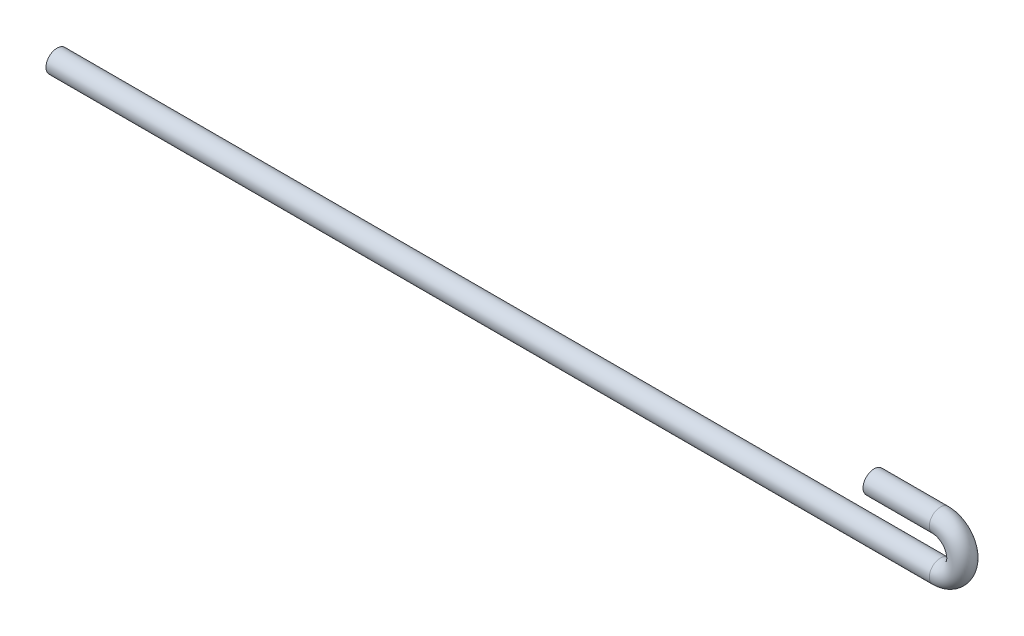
ISO-10303-21;
HEADER;
FILE_DESCRIPTION(('STEP AP214'),'2;1');
FILE_NAME('part.step','',(''),(''),'','','');
FILE_SCHEMA(('AUTOMOTIVE_DESIGN { 1 0 10303 214 1 1 1 1 }'));
ENDSEC;
DATA;
#1=APPLICATION_CONTEXT('core data for automotive mechanical design processes');
#2=APPLICATION_PROTOCOL_DEFINITION('international standard','automotive_design',2000,#1);
#3=PRODUCT_CONTEXT('',#1,'mechanical');
#4=PRODUCT('Part','Part','',(#3));
#5=PRODUCT_RELATED_PRODUCT_CATEGORY('part','',(#4));
#6=PRODUCT_DEFINITION_FORMATION('','',#4);
#7=PRODUCT_DEFINITION_CONTEXT('part definition',#1,'design');
#8=PRODUCT_DEFINITION('design','',#6,#7);
#9=PRODUCT_DEFINITION_SHAPE('','',#8);
#10=(LENGTH_UNIT() NAMED_UNIT(*) SI_UNIT(.MILLI.,.METRE.));
#11=(NAMED_UNIT(*) PLANE_ANGLE_UNIT() SI_UNIT($,.RADIAN.));
#12=(NAMED_UNIT(*) SI_UNIT($,.STERADIAN.) SOLID_ANGLE_UNIT());
#13=UNCERTAINTY_MEASURE_WITH_UNIT(LENGTH_MEASURE(1.E-05),#10,'distance_accuracy_value','');
#14=(GEOMETRIC_REPRESENTATION_CONTEXT(3) GLOBAL_UNCERTAINTY_ASSIGNED_CONTEXT((#13)) GLOBAL_UNIT_ASSIGNED_CONTEXT((#10,
#11,#12)) REPRESENTATION_CONTEXT('',''));
#15=CARTESIAN_POINT('',(0.,0.,0.));
#16=DIRECTION('',(0.,0.,1.));
#17=DIRECTION('',(1.,0.,0.));
#18=AXIS2_PLACEMENT_3D('',#15,#16,#17);
#19=CARTESIAN_POINT('',(20.,1.,0.));
#20=DIRECTION('',(-1.,0.,0.));
#21=DIRECTION('',(0.,0.,1.));
#22=AXIS2_PLACEMENT_3D('',#19,#20,#21);
#23=CYLINDRICAL_SURFACE('',#22,0.25);
#24=CARTESIAN_POINT('',(20.,1.,0.));
#25=DIRECTION('',(-1.,0.,0.));
#26=DIRECTION('',(0.,0.,-1.));
#27=AXIS2_PLACEMENT_3D('',#24,#25,#26);
#28=CIRCLE('',#27,0.25);
#29=CARTESIAN_POINT('',(20.,1.25,0.));
#30=VERTEX_POINT('',#29);
#31=EDGE_CURVE('E36',#30,#30,#28,.T.);
#32=ORIENTED_EDGE('',*,*,#31,.T.);
#33=EDGE_LOOP('',(#32));
#34=FACE_BOUND('',#33,.T.);
#35=CARTESIAN_POINT('',(18.5,1.,0.));
#36=DIRECTION('',(-1.,0.,0.));
#37=DIRECTION('',(0.,0.,-1.));
#38=AXIS2_PLACEMENT_3D('',#35,#36,#37);
#39=CIRCLE('',#38,0.25);
#40=CARTESIAN_POINT('',(18.5,1.,-0.25));
#41=VERTEX_POINT('',#40);
#42=EDGE_CURVE('E10',#41,#41,#39,.T.);
#43=ORIENTED_EDGE('',*,*,#42,.F.);
#44=EDGE_LOOP('',(#43));
#45=FACE_BOUND('',#44,.T.);
#46=ADVANCED_FACE('F30',(#34,#45),#23,.T.);
#47=CARTESIAN_POINT('',(20.,0.5,0.));
#48=DIRECTION('',(0.,0.,1.));
#49=DIRECTION('',(1.,0.,0.));
#50=AXIS2_PLACEMENT_3D('',#47,#48,#49);
#51=TOROIDAL_SURFACE('',#50,0.5,0.25);
#52=CARTESIAN_POINT('',(20.,0.,0.));
#53=DIRECTION('',(1.,0.,0.));
#54=DIRECTION('',(0.,0.,-1.));
#55=AXIS2_PLACEMENT_3D('',#52,#53,#54);
#56=CIRCLE('',#55,0.25);
#57=CARTESIAN_POINT('',(20.,-0.25,0.));
#58=VERTEX_POINT('',#57);
#59=EDGE_CURVE('E40',#58,#58,#56,.T.);
#60=CARTESIAN_POINT('',(20.,0.5,0.));
#61=DIRECTION('',(0.,0.,1.));
#62=DIRECTION('',(1.,0.,0.));
#63=AXIS2_PLACEMENT_3D('',#60,#61,#62);
#64=CIRCLE('',#63,0.75);
#65=EDGE_CURVE('',#58,#30,#64,.T.);
#66=ORIENTED_EDGE('',*,*,#59,.T.);
#67=ORIENTED_EDGE('',*,*,#31,.F.);
#68=ORIENTED_EDGE('',*,*,#65,.T.);
#69=ORIENTED_EDGE('',*,*,#65,.F.);
#70=EDGE_LOOP('',(#66,#68,#67,#69));
#71=FACE_BOUND('',#70,.T.);
#72=ADVANCED_FACE('F61',(#71),#51,.T.);
#73=CARTESIAN_POINT('',(20.,0.,0.));
#74=DIRECTION('',(-1.,0.,0.));
#75=DIRECTION('',(0.,0.,1.));
#76=AXIS2_PLACEMENT_3D('',#73,#74,#75);
#77=CYLINDRICAL_SURFACE('',#76,0.25);
#78=ORIENTED_EDGE('',*,*,#59,.F.);
#79=EDGE_LOOP('',(#78));
#80=FACE_BOUND('',#79,.T.);
#81=CARTESIAN_POINT('',(0.,0.,0.));
#82=DIRECTION('',(1.,0.,0.));
#83=DIRECTION('',(0.,0.,-1.));
#84=AXIS2_PLACEMENT_3D('',#81,#82,#83);
#85=CIRCLE('',#84,0.25);
#86=CARTESIAN_POINT('',(0.,0.,-0.25));
#87=VERTEX_POINT('',#86);
#88=EDGE_CURVE('E44',#87,#87,#85,.T.);
#89=ORIENTED_EDGE('',*,*,#88,.T.);
#90=EDGE_LOOP('',(#89));
#91=FACE_BOUND('',#90,.T.);
#92=ADVANCED_FACE('F50',(#80,#91),#77,.T.);
#93=CARTESIAN_POINT('',(18.5,1.,0.));
#94=DIRECTION('',(-1.,0.,0.));
#95=DIRECTION('',(0.,0.,-1.));
#96=AXIS2_PLACEMENT_3D('',#93,#94,#95);
#97=PLANE('',#96);
#98=ORIENTED_EDGE('',*,*,#42,.T.);
#99=EDGE_LOOP('',(#98));
#100=FACE_BOUND('',#99,.T.);
#101=ADVANCED_FACE('F54',(#100),#97,.T.);
#102=CARTESIAN_POINT('',(0.,0.,0.));
#103=DIRECTION('',(1.,0.,0.));
#104=DIRECTION('',(0.,0.,-1.));
#105=AXIS2_PLACEMENT_3D('',#102,#103,#104);
#106=PLANE('',#105);
#107=ORIENTED_EDGE('',*,*,#88,.F.);
#108=EDGE_LOOP('',(#107));
#109=FACE_BOUND('',#108,.T.);
#110=ADVANCED_FACE('F52',(#109),#106,.F.);
#111=CLOSED_SHELL('',(#46,#72,#92,#101,#110));
#112=MANIFOLD_SOLID_BREP('B2',#111);
#113=ADVANCED_BREP_SHAPE_REPRESENTATION('',(#18,#112),#14);
#114=SHAPE_DEFINITION_REPRESENTATION(#9,#113);
ENDSEC;
END-ISO-10303-21;
